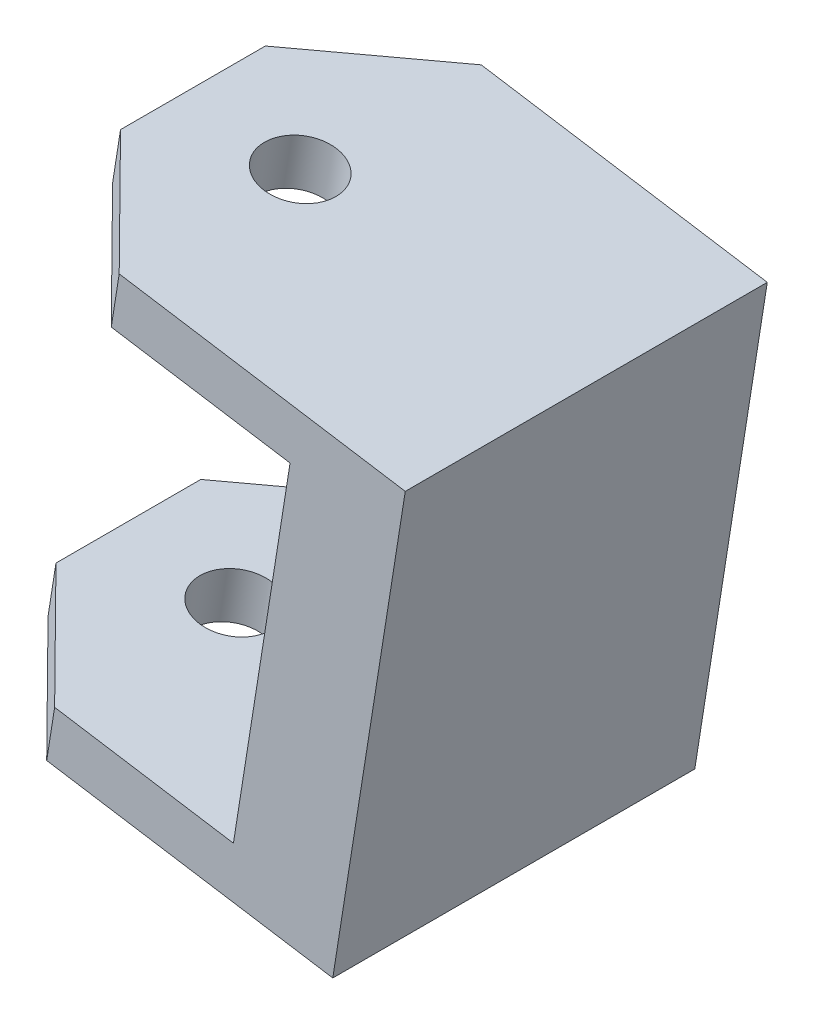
from build123d import *

# Parameters (mm, degrees)
BASE_EXTRUSION_DEPTH    = 25
CHANFREIN1_SIZE         = 15
ESQUISSE2_R             = 5
ENL_V_MAT_EXTRU_1_DEPTH = 351.605102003


with BuildPart() as part:
    # Esquisse1 → Base-Extrusion (new, symmetric)
    with BuildSketch(Plane.XY):
        Polygon((-330.904463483, 83.03872549), (-291.396929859, 76.781346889), (-299.218653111, 27.396929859), (-338.726186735, 33.654308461), (-339.82122799, 26.740490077), (-285.498369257, 18.136594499), (-275.486563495, 81.348648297), (-329.809422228, 89.952543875), align=None)
    extrude(amount=BASE_EXTRUSION_DEPTH, both=True)

    # Chanfrein1
    chanfrein1_edges = [part.edges().sort_by_distance(p)[0] for p in [
        (-330.356942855, 86.495634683, -25),
        (-330.356942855, 86.495634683, 25),
        (-339.273707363, 30.197399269, -25),
        (-339.273707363, 30.197399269, 25),
    ]]
    chamfer(chanfrein1_edges, length=CHANFREIN1_SIZE)

    # Esquisse2 → Enl_v. mat.-Extru.1 (cut, through all)
    with BuildSketch(Plane(origin=(5.827421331, 36.792890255, 0), x_dir=(-0.9876883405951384, 0.15643446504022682, 0), z_dir=(0.15643446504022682, 0.9876883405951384, 0))):
        with Locations((324.820599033, 0)):
            Circle(ESQUISSE2_R)
    extrude(amount=-ENL_V_MAT_EXTRU_1_DEPTH, mode=Mode.SUBTRACT)


solid = part.part
